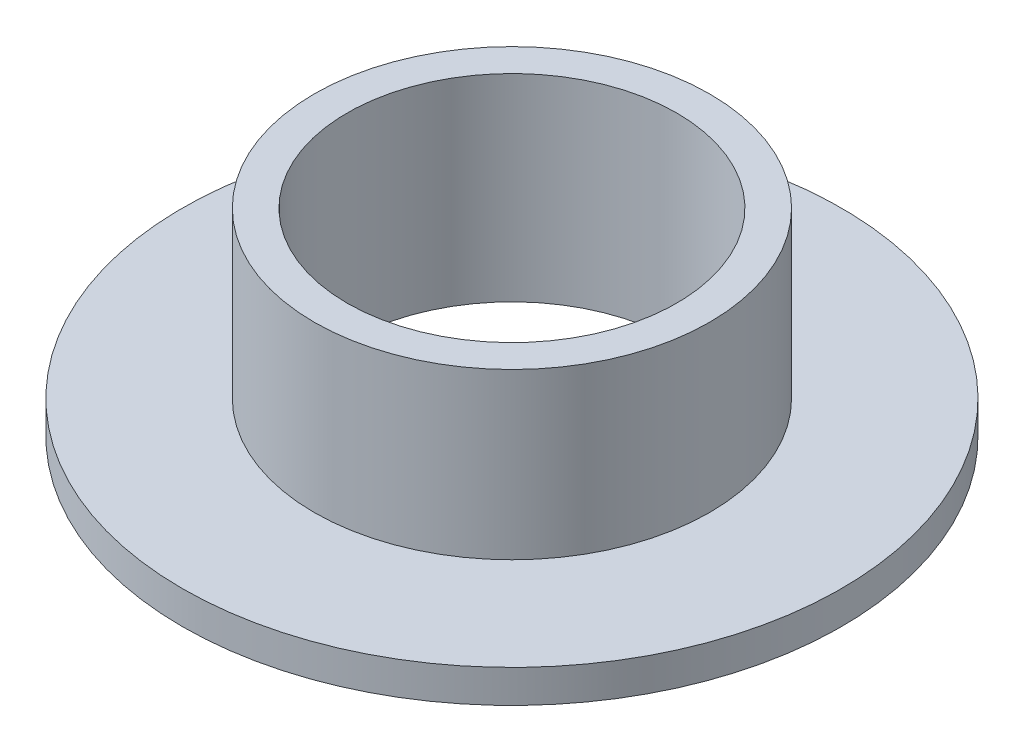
from build123d import *

# Parameters (mm, degrees)
SKETCH1_R           = 50
SKETCH1_R_2         = 25
BOSS_EXTRUDE1_DEPTH = 5
SKETCH2_R           = 30
SKETCH2_R_2         = 25
BOSS_EXTRUDE2_DEPTH = 25


with BuildPart() as part:
    # Sketch1 → Boss-Extrude1 (new body)
    with BuildSketch(Plane(origin=(0, 0, 0), x_dir=(1, 0, 0), z_dir=(0, 1, 0))):
        with Locations(Location((0, 0, 0), (0, 0, 270))):
            Circle(SKETCH1_R)
        with Locations(Location((0, 0, 0), (0, 0, 270))):
            Circle(SKETCH1_R_2, mode=Mode.SUBTRACT)
    extrude(amount=BOSS_EXTRUDE1_DEPTH)

    # Sketch2 → Boss-Extrude2 (add)
    with BuildSketch(Plane(origin=(0, 5, 0), x_dir=(1, 0, 0), z_dir=(0, 1, 0))):
        with Locations(Location((0, 0, 0), (0, 0, 270))):
            Circle(SKETCH2_R)
        with Locations(Location((0, 0, 0), (0, 0, 270))):
            Circle(SKETCH2_R_2, mode=Mode.SUBTRACT)
    extrude(amount=BOSS_EXTRUDE2_DEPTH)


solid = part.part
